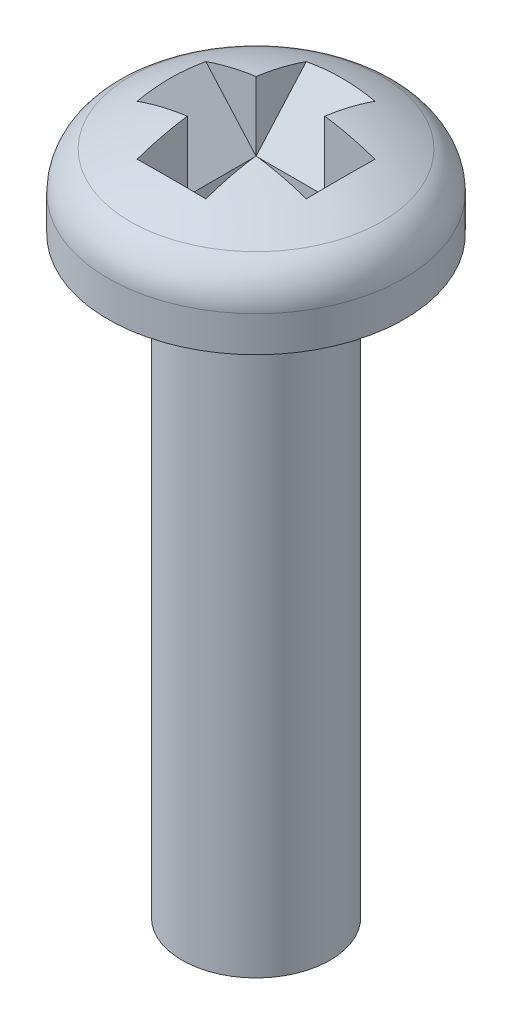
from build123d import *

# Parameters (mm, degrees)
SKETCH2_W          = 1.5875
SKETCH2_H          = 12.7
CUT_EXTRUDE1_DEPTH = 0.736599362
CUT_EXTRUDE2_DEPTH = 0.736599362


with BuildPart() as part:
    # Sketch1 → Base-Revolve (revolve)
    with BuildSketch(Plane.XY, mode=Mode.PRIVATE) as base_revolve_sk:
        with BuildLine():
            Line((0, 0), (3.175, 0))
            Line((3.175, 0), (3.175, 0.762))
            ThreePointArc((3.175, 0.762), (3.047218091, 1.234139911), (2.698756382, 1.577387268))
            ThreePointArc((2.698756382, 1.577387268), (1.395118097, 2.105894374), (0, 2.286))
            Line((0, 2.286), (0, 0))
        make_face()
    revolve(base_revolve_sk.sketch.rotate(Axis((0, 0, 0), (0, 1, 0)), 90), axis=Axis((0, 0, 0), (0, 1, 0)))

    # Sketch2 → Boss-Revolve1 (revolve)
    with BuildSketch(Plane.XY):
        with Locations((0.79375, -6.35)):
            Rectangle(SKETCH2_W, SKETCH2_H)
    revolve(axis=Axis((0, 0, 0), (0, 1, 0)))

    # Sketch3 → Cut-Extrude1 (cut, symmetric)
    with BuildSketch(Plane.XY):
        Polygon((-4.038596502, 6.667494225), (4.038596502, 6.667494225), (4.038596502, 4.44499615), (0, -0.12699989), (-4.038596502, 4.44499615), align=None)
    extrude(amount=CUT_EXTRUDE1_DEPTH, both=True, mode=Mode.SUBTRACT)

    # Sketch4 → Cut-Extrude2 (cut, symmetric)
    with BuildSketch(Plane(origin=(0, 0, 0), x_dir=(0, 0, -1), z_dir=(1, 0, 0))):
        Polygon((-4.038596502, 6.667494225), (4.038596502, 6.667494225), (4.038596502, 4.44499615), (0, -0.12699989), (-4.038596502, 4.44499615), align=None)
    extrude(amount=CUT_EXTRUDE2_DEPTH, both=True, mode=Mode.SUBTRACT)


solid = part.part
